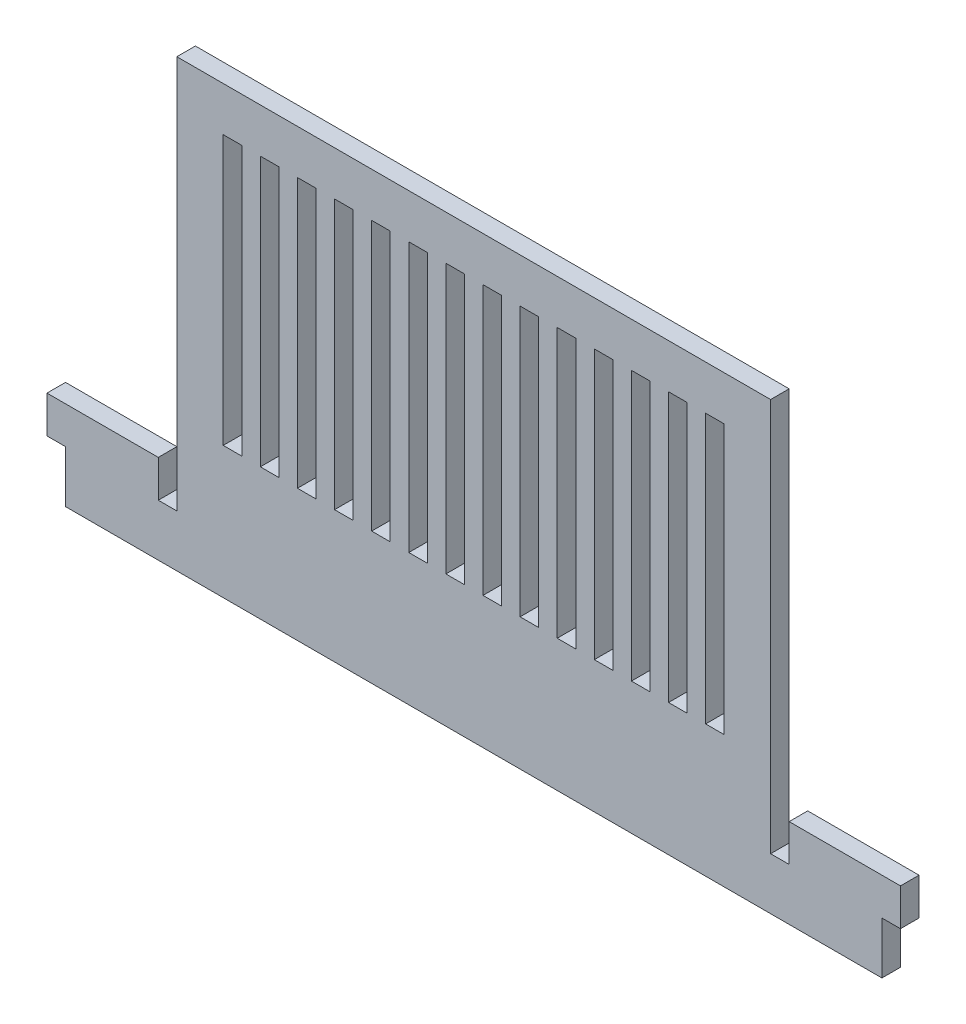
from build123d import *

# Parameters (mm, degrees)
SKETCH1_W           = 3.175
SKETCH1_H           = 46.050095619
BOSS_EXTRUDE1_DEPTH = 3.175


with BuildPart() as part:
    # Sketch1 → Boss-Extrude1 (new body)
    with BuildSketch(Plane.XY):
        Polygon((-142.875, -7.62), (-3.175, -7.62), (-3.175, 1.27), (0, 1.27), (0, 7.62), (-19.05, 7.62), (-19.05, 1.27), (-22.225, 1.27), (-22.225, 68.58), (-123.825, 68.58), (-123.825, 1.27), (-127, 1.27), (-127, 7.62), (-146.05, 7.62), (-146.05, 1.27), (-142.875, 1.27), align=None)
        with Locations((-69.85, 37.974112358)):
            Rectangle(SKETCH1_W, SKETCH1_H, mode=Mode.SUBTRACT)
        with Locations((-63.5, 37.974112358)):
            Rectangle(SKETCH1_W, SKETCH1_H, mode=Mode.SUBTRACT)
        with Locations((-57.15, 37.974112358)):
            Rectangle(SKETCH1_W, SKETCH1_H, mode=Mode.SUBTRACT)
        with Locations((-50.8, 37.974112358)):
            Rectangle(SKETCH1_W, SKETCH1_H, mode=Mode.SUBTRACT)
        with Locations((-44.45, 37.974112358)):
            Rectangle(SKETCH1_W, SKETCH1_H, mode=Mode.SUBTRACT)
        with Locations((-38.1, 37.974112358)):
            Rectangle(SKETCH1_W, SKETCH1_H, mode=Mode.SUBTRACT)
        with Locations((-31.75, 37.974112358)):
            Rectangle(SKETCH1_W, SKETCH1_H, mode=Mode.SUBTRACT)
        with Locations((-114.3, 37.974112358)):
            Rectangle(SKETCH1_W, SKETCH1_H, mode=Mode.SUBTRACT)
        with Locations((-107.95, 37.974112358)):
            Rectangle(SKETCH1_W, SKETCH1_H, mode=Mode.SUBTRACT)
        with Locations((-101.6, 37.974112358)):
            Rectangle(SKETCH1_W, SKETCH1_H, mode=Mode.SUBTRACT)
        with Locations((-95.25, 37.974112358)):
            Rectangle(SKETCH1_W, SKETCH1_H, mode=Mode.SUBTRACT)
        with Locations((-88.9, 37.974112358)):
            Rectangle(SKETCH1_W, SKETCH1_H, mode=Mode.SUBTRACT)
        with Locations((-82.55, 37.974112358)):
            Rectangle(SKETCH1_W, SKETCH1_H, mode=Mode.SUBTRACT)
        with Locations((-76.2, 37.974112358)):
            Rectangle(SKETCH1_W, SKETCH1_H, mode=Mode.SUBTRACT)
    extrude(amount=BOSS_EXTRUDE1_DEPTH)


solid = part.part
